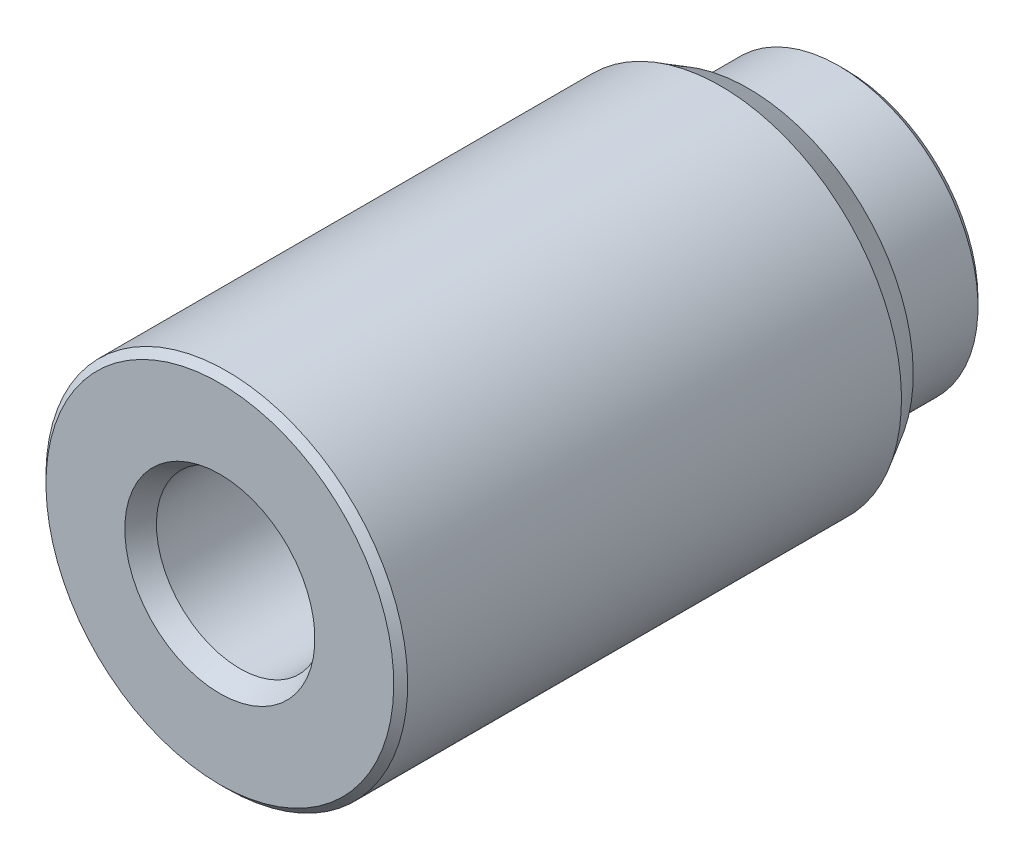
ISO-10303-21;
HEADER;
FILE_DESCRIPTION(('STEP AP214'),'2;1');
FILE_NAME('part.step','',(''),(''),'','','');
FILE_SCHEMA(('AUTOMOTIVE_DESIGN { 1 0 10303 214 1 1 1 1 }'));
ENDSEC;
DATA;
#1=APPLICATION_CONTEXT('core data for automotive mechanical design processes');
#2=APPLICATION_PROTOCOL_DEFINITION('international standard','automotive_design',2000,#1);
#3=PRODUCT_CONTEXT('',#1,'mechanical');
#4=PRODUCT('Part','Part','',(#3));
#5=PRODUCT_RELATED_PRODUCT_CATEGORY('part','',(#4));
#6=PRODUCT_DEFINITION_FORMATION('','',#4);
#7=PRODUCT_DEFINITION_CONTEXT('part definition',#1,'design');
#8=PRODUCT_DEFINITION('design','',#6,#7);
#9=PRODUCT_DEFINITION_SHAPE('','',#8);
#10=(LENGTH_UNIT() NAMED_UNIT(*) SI_UNIT(.MILLI.,.METRE.));
#11=(NAMED_UNIT(*) PLANE_ANGLE_UNIT() SI_UNIT($,.RADIAN.));
#12=(NAMED_UNIT(*) SI_UNIT($,.STERADIAN.) SOLID_ANGLE_UNIT());
#13=UNCERTAINTY_MEASURE_WITH_UNIT(LENGTH_MEASURE(1.E-05),#10,'distance_accuracy_value','');
#14=(GEOMETRIC_REPRESENTATION_CONTEXT(3) GLOBAL_UNCERTAINTY_ASSIGNED_CONTEXT((#13)) GLOBAL_UNIT_ASSIGNED_CONTEXT((#10,
#11,#12)) REPRESENTATION_CONTEXT('',''));
#15=CARTESIAN_POINT('',(0.,0.,0.));
#16=DIRECTION('',(0.,0.,1.));
#17=DIRECTION('',(1.,0.,0.));
#18=AXIS2_PLACEMENT_3D('',#15,#16,#17);
#19=CARTESIAN_POINT('',(0.,0.,45.));
#20=DIRECTION('',(0.,0.,1.));
#21=DIRECTION('',(0.,-1.,0.));
#22=AXIS2_PLACEMENT_3D('',#19,#20,#21);
#23=CYLINDRICAL_SURFACE('',#22,5.1);
#24=CARTESIAN_POINT('',(0.,0.,2.));
#25=DIRECTION('',(0.,0.,1.));
#26=DIRECTION('',(0.,-1.,0.));
#27=AXIS2_PLACEMENT_3D('',#24,#25,#26);
#28=CIRCLE('',#27,5.1);
#29=CARTESIAN_POINT('',(0.,-5.1,2.));
#30=VERTEX_POINT('',#29);
#31=EDGE_CURVE('E8',#30,#30,#28,.F.);
#32=ORIENTED_EDGE('',*,*,#31,.T.);
#33=EDGE_LOOP('',(#32));
#34=FACE_BOUND('',#33,.T.);
#35=CARTESIAN_POINT('',(0.,0.,21.));
#36=DIRECTION('',(0.,0.,1.));
#37=DIRECTION('',(1.,0.,0.));
#38=AXIS2_PLACEMENT_3D('',#35,#36,#37);
#39=CIRCLE('',#38,5.1);
#40=CARTESIAN_POINT('',(5.1,0.,21.));
#41=VERTEX_POINT('',#40);
#42=EDGE_CURVE('E16',#41,#41,#39,.F.);
#43=ORIENTED_EDGE('',*,*,#42,.F.);
#44=EDGE_LOOP('',(#43));
#45=FACE_BOUND('',#44,.T.);
#46=ADVANCED_FACE('F12',(#34,#45),#23,.F.);
#47=CARTESIAN_POINT('',(0.,0.,-8.50755703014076));
#48=DIRECTION('',(0.,0.,1.));
#49=DIRECTION('',(0.,-1.,0.));
#50=AXIS2_PLACEMENT_3D('',#47,#48,#49);
#51=CYLINDRICAL_SURFACE('',#50,13.);
#52=CARTESIAN_POINT('',(0.,0.,44.5));
#53=DIRECTION('',(0.,0.,1.));
#54=DIRECTION('',(0.,-1.,0.));
#55=AXIS2_PLACEMENT_3D('',#52,#53,#54);
#56=CIRCLE('',#55,13.);
#57=CARTESIAN_POINT('',(0.,-13.,44.5));
#58=VERTEX_POINT('',#57);
#59=EDGE_CURVE('E57',#58,#58,#56,.T.);
#60=ORIENTED_EDGE('',*,*,#59,.F.);
#61=EDGE_LOOP('',(#60));
#62=FACE_BOUND('',#61,.T.);
#63=CARTESIAN_POINT('',(0.,0.,9.));
#64=DIRECTION('',(0.,0.,1.));
#65=DIRECTION('',(0.,-1.,0.));
#66=AXIS2_PLACEMENT_3D('',#63,#64,#65);
#67=CIRCLE('',#66,13.);
#68=CARTESIAN_POINT('',(0.,-13.,9.));
#69=VERTEX_POINT('',#68);
#70=EDGE_CURVE('E54',#69,#69,#67,.T.);
#71=ORIENTED_EDGE('',*,*,#70,.T.);
#72=EDGE_LOOP('',(#71));
#73=FACE_BOUND('',#72,.T.);
#74=ADVANCED_FACE('F80',(#62,#73),#51,.T.);
#75=CARTESIAN_POINT('',(0.,0.,44.5));
#76=DIRECTION('',(0.,0.,-1.));
#77=DIRECTION('',(0.,1.,0.));
#78=AXIS2_PLACEMENT_3D('',#75,#76,#77);
#79=CONICAL_SURFACE('',#78,13.,0.785398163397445);
#80=CARTESIAN_POINT('',(0.,0.,45.));
#81=DIRECTION('',(0.,0.,1.));
#82=DIRECTION('',(0.,-1.,0.));
#83=AXIS2_PLACEMENT_3D('',#80,#81,#82);
#84=CIRCLE('',#83,12.5);
#85=CARTESIAN_POINT('',(0.,-12.5,45.));
#86=VERTEX_POINT('',#85);
#87=EDGE_CURVE('E34',#86,#86,#84,.T.);
#88=ORIENTED_EDGE('',*,*,#87,.F.);
#89=EDGE_LOOP('',(#88));
#90=FACE_BOUND('',#89,.T.);
#91=ORIENTED_EDGE('',*,*,#59,.T.);
#92=EDGE_LOOP('',(#91));
#93=FACE_BOUND('',#92,.T.);
#94=ADVANCED_FACE('F86',(#90,#93),#79,.T.);
#95=CARTESIAN_POINT('',(0.,0.,7.));
#96=DIRECTION('',(0.,0.,1.));
#97=DIRECTION('',(0.,-1.,0.));
#98=AXIS2_PLACEMENT_3D('',#95,#96,#97);
#99=CONICAL_SURFACE('',#98,11.8452994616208,0.523598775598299);
#100=ORIENTED_EDGE('',*,*,#70,.F.);
#101=EDGE_LOOP('',(#100));
#102=FACE_BOUND('',#101,.T.);
#103=CARTESIAN_POINT('',(0.,0.,7.));
#104=DIRECTION('',(0.,0.,1.));
#105=DIRECTION('',(0.,-1.,0.));
#106=AXIS2_PLACEMENT_3D('',#103,#104,#105);
#107=CIRCLE('',#106,11.8452994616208);
#108=CARTESIAN_POINT('',(0.,-11.8452994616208,7.));
#109=VERTEX_POINT('',#108);
#110=EDGE_CURVE('E51',#109,#109,#107,.T.);
#111=ORIENTED_EDGE('',*,*,#110,.T.);
#112=EDGE_LOOP('',(#111));
#113=FACE_BOUND('',#112,.T.);
#114=ADVANCED_FACE('F108',(#102,#113),#99,.T.);
#115=CARTESIAN_POINT('',(11.8452994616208,0.,7.));
#116=DIRECTION('',(0.,0.,1.));
#117=DIRECTION('',(0.,-1.,0.));
#118=AXIS2_PLACEMENT_3D('',#115,#116,#117);
#119=PLANE('',#118);
#120=ORIENTED_EDGE('',*,*,#110,.F.);
#121=EDGE_LOOP('',(#120));
#122=FACE_BOUND('',#121,.T.);
#123=CARTESIAN_POINT('',(0.,0.,7.));
#124=DIRECTION('',(0.,0.,1.));
#125=DIRECTION('',(0.,-1.,0.));
#126=AXIS2_PLACEMENT_3D('',#123,#124,#125);
#127=CIRCLE('',#126,10.);
#128=CARTESIAN_POINT('',(0.,-10.,7.));
#129=VERTEX_POINT('',#128);
#130=EDGE_CURVE('E48',#129,#129,#127,.T.);
#131=ORIENTED_EDGE('',*,*,#130,.T.);
#132=EDGE_LOOP('',(#131));
#133=FACE_BOUND('',#132,.T.);
#134=ADVANCED_FACE('F104',(#122,#133),#119,.F.);
#135=CARTESIAN_POINT('',(0.,0.,-8.50755703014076));
#136=DIRECTION('',(0.,0.,1.));
#137=DIRECTION('',(0.,-1.,0.));
#138=AXIS2_PLACEMENT_3D('',#135,#136,#137);
#139=CYLINDRICAL_SURFACE('',#138,10.);
#140=ORIENTED_EDGE('',*,*,#130,.F.);
#141=EDGE_LOOP('',(#140));
#142=FACE_BOUND('',#141,.T.);
#143=CARTESIAN_POINT('',(0.,0.,0.5));
#144=DIRECTION('',(0.,0.,1.));
#145=DIRECTION('',(0.,-1.,0.));
#146=AXIS2_PLACEMENT_3D('',#143,#144,#145);
#147=CIRCLE('',#146,10.);
#148=CARTESIAN_POINT('',(0.,-10.,0.500000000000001));
#149=VERTEX_POINT('',#148);
#150=EDGE_CURVE('E45',#149,#149,#147,.T.);
#151=ORIENTED_EDGE('',*,*,#150,.T.);
#152=EDGE_LOOP('',(#151));
#153=FACE_BOUND('',#152,.T.);
#154=ADVANCED_FACE('F100',(#142,#153),#139,.T.);
#155=CARTESIAN_POINT('',(0.,0.,0.));
#156=DIRECTION('',(0.,0.,1.));
#157=DIRECTION('',(0.,-1.,0.));
#158=AXIS2_PLACEMENT_3D('',#155,#156,#157);
#159=CONICAL_SURFACE('',#158,9.5,0.78539816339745);
#160=ORIENTED_EDGE('',*,*,#150,.F.);
#161=EDGE_LOOP('',(#160));
#162=FACE_BOUND('',#161,.T.);
#163=CARTESIAN_POINT('',(0.,0.,0.));
#164=DIRECTION('',(0.,0.,1.));
#165=DIRECTION('',(0.,-1.,0.));
#166=AXIS2_PLACEMENT_3D('',#163,#164,#165);
#167=CIRCLE('',#166,9.5);
#168=CARTESIAN_POINT('',(0.,-9.5,0.));
#169=VERTEX_POINT('',#168);
#170=EDGE_CURVE('E42',#169,#169,#167,.T.);
#171=ORIENTED_EDGE('',*,*,#170,.T.);
#172=EDGE_LOOP('',(#171));
#173=FACE_BOUND('',#172,.T.);
#174=ADVANCED_FACE('F96',(#162,#173),#159,.T.);
#175=CARTESIAN_POINT('',(9.5,0.,0.));
#176=DIRECTION('',(0.,0.,1.));
#177=DIRECTION('',(0.,-1.,0.));
#178=AXIS2_PLACEMENT_3D('',#175,#176,#177);
#179=PLANE('',#178);
#180=CARTESIAN_POINT('',(0.,0.,0.));
#181=DIRECTION('',(0.,0.,1.));
#182=DIRECTION('',(0.,-1.,0.));
#183=AXIS2_PLACEMENT_3D('',#180,#181,#182);
#184=CIRCLE('',#183,6.25470053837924);
#185=CARTESIAN_POINT('',(0.,-6.25470053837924,0.));
#186=VERTEX_POINT('',#185);
#187=EDGE_CURVE('E20',#186,#186,#184,.T.);
#188=ORIENTED_EDGE('',*,*,#187,.T.);
#189=EDGE_LOOP('',(#188));
#190=FACE_BOUND('',#189,.T.);
#191=ORIENTED_EDGE('',*,*,#170,.F.);
#192=EDGE_LOOP('',(#191));
#193=FACE_BOUND('',#192,.T.);
#194=ADVANCED_FACE('F76',(#190,#193),#179,.F.);
#195=CARTESIAN_POINT('',(12.5,0.,45.));
#196=DIRECTION('',(0.,0.,-1.));
#197=DIRECTION('',(0.,1.,0.));
#198=AXIS2_PLACEMENT_3D('',#195,#196,#197);
#199=PLANE('',#198);
#200=CARTESIAN_POINT('',(0.,0.,45.));
#201=DIRECTION('',(0.,0.,-1.));
#202=DIRECTION('',(0.,1.,0.));
#203=AXIS2_PLACEMENT_3D('',#200,#201,#202);
#204=CIRCLE('',#203,6.83205080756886);
#205=CARTESIAN_POINT('',(0.,6.83205080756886,45.));
#206=VERTEX_POINT('',#205);
#207=EDGE_CURVE('E25',#206,#206,#204,.T.);
#208=ORIENTED_EDGE('',*,*,#207,.T.);
#209=EDGE_LOOP('',(#208));
#210=FACE_BOUND('',#209,.T.);
#211=ORIENTED_EDGE('',*,*,#87,.T.);
#212=EDGE_LOOP('',(#211));
#213=FACE_BOUND('',#212,.T.);
#214=ADVANCED_FACE('F62',(#210,#213),#199,.F.);
#215=CARTESIAN_POINT('',(0.,0.,42.));
#216=DIRECTION('',(0.,0.,1.));
#217=DIRECTION('',(0.,-1.,0.));
#218=AXIS2_PLACEMENT_3D('',#215,#216,#217);
#219=CONICAL_SURFACE('',#218,5.1,0.523598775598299);
#220=CARTESIAN_POINT('',(0.,0.,43.558845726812));
#221=DIRECTION('',(0.,0.,1.));
#222=DIRECTION('',(0.,-1.,0.));
#223=AXIS2_PLACEMENT_3D('',#220,#221,#222);
#224=CIRCLE('',#223,6.);
#225=CARTESIAN_POINT('',(0.,-6.,43.558845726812));
#226=VERTEX_POINT('',#225);
#227=EDGE_CURVE('E28',#226,#226,#224,.T.);
#228=ORIENTED_EDGE('',*,*,#227,.F.);
#229=EDGE_LOOP('',(#228));
#230=FACE_BOUND('',#229,.T.);
#231=ORIENTED_EDGE('',*,*,#207,.F.);
#232=EDGE_LOOP('',(#231));
#233=FACE_BOUND('',#232,.T.);
#234=ADVANCED_FACE('F65',(#230,#233),#219,.F.);
#235=CARTESIAN_POINT('',(0.,0.,0.));
#236=DIRECTION('',(0.,0.,-1.));
#237=DIRECTION('',(0.,1.,0.));
#238=AXIS2_PLACEMENT_3D('',#235,#236,#237);
#239=CONICAL_SURFACE('',#238,6.25470053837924,0.523598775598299);
#240=ORIENTED_EDGE('',*,*,#31,.F.);
#241=EDGE_LOOP('',(#240));
#242=FACE_BOUND('',#241,.T.);
#243=ORIENTED_EDGE('',*,*,#187,.F.);
#244=EDGE_LOOP('',(#243));
#245=FACE_BOUND('',#244,.T.);
#246=ADVANCED_FACE('F14',(#242,#245),#239,.F.);
#247=CARTESIAN_POINT('',(0.,0.,21.));
#248=DIRECTION('',(0.,0.,1.));
#249=DIRECTION('',(1.,0.,0.));
#250=AXIS2_PLACEMENT_3D('',#247,#248,#249);
#251=PLANE('',#250);
#252=CARTESIAN_POINT('',(0.,0.,21.));
#253=DIRECTION('',(0.,0.,1.));
#254=DIRECTION('',(1.,0.,0.));
#255=AXIS2_PLACEMENT_3D('',#252,#253,#254);
#256=CIRCLE('',#255,6.);
#257=CARTESIAN_POINT('',(6.,0.,21.));
#258=VERTEX_POINT('',#257);
#259=EDGE_CURVE('E30',#258,#258,#256,.T.);
#260=ORIENTED_EDGE('',*,*,#259,.T.);
#261=EDGE_LOOP('',(#260));
#262=FACE_BOUND('',#261,.T.);
#263=ORIENTED_EDGE('',*,*,#42,.T.);
#264=EDGE_LOOP('',(#263));
#265=FACE_BOUND('',#264,.T.);
#266=ADVANCED_FACE('F74',(#262,#265),#251,.T.);
#267=CARTESIAN_POINT('',(0.,0.,21.));
#268=DIRECTION('',(0.,0.,1.));
#269=DIRECTION('',(1.,0.,0.));
#270=AXIS2_PLACEMENT_3D('',#267,#268,#269);
#271=CYLINDRICAL_SURFACE('',#270,6.);
#272=ORIENTED_EDGE('',*,*,#227,.T.);
#273=EDGE_LOOP('',(#272));
#274=FACE_BOUND('',#273,.T.);
#275=ORIENTED_EDGE('',*,*,#259,.F.);
#276=EDGE_LOOP('',(#275));
#277=FACE_BOUND('',#276,.T.);
#278=ADVANCED_FACE('F91',(#274,#277),#271,.F.);
#279=CLOSED_SHELL('',(#46,#74,#94,#114,#134,#154,#174,#194,#214,#234,#246,#266,#278));
#280=MANIFOLD_SOLID_BREP('B1',#279);
#281=ADVANCED_BREP_SHAPE_REPRESENTATION('',(#18,#280),#14);
#282=SHAPE_DEFINITION_REPRESENTATION(#9,#281);
ENDSEC;
END-ISO-10303-21;
